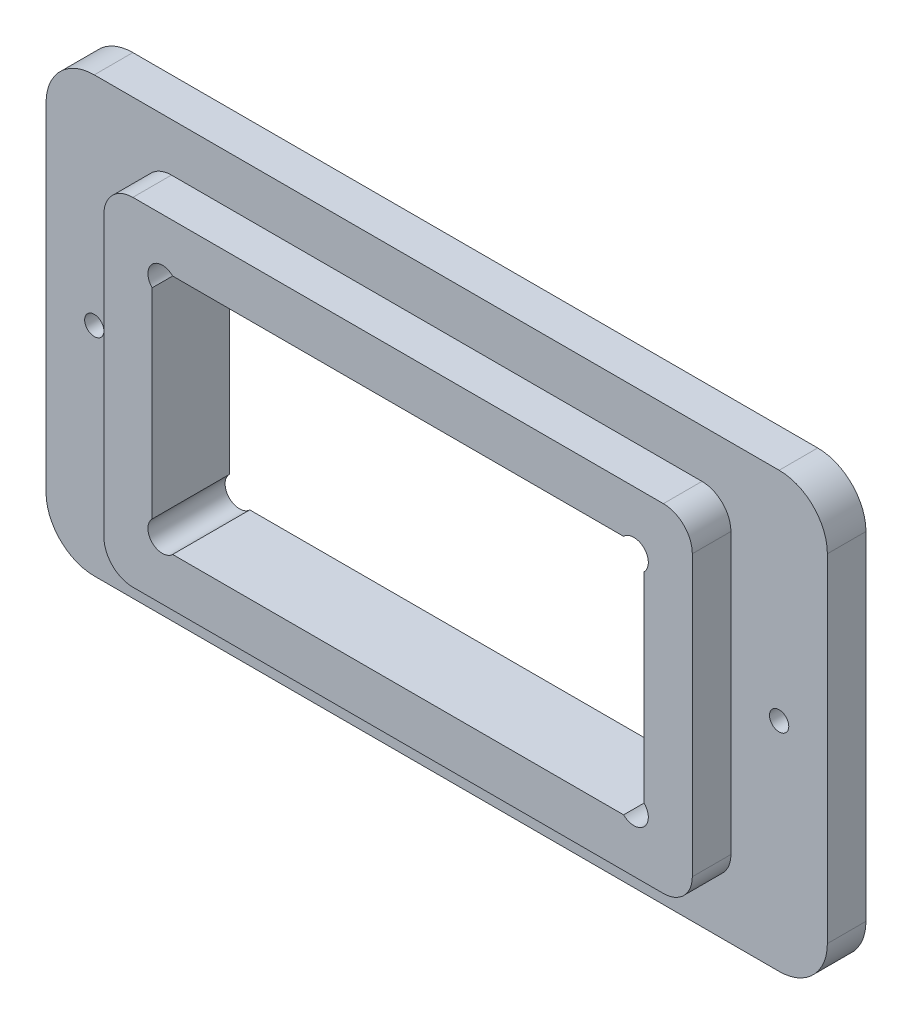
from build123d import *

# Parameters (mm, degrees)
BOSS_EXTRU_1_DEPTH      = 8
ESQUISSE2_OUTSIDE_W     = 101.602
ESQUISSE2_OUTSIDE_H     = 65.602
ESQUISSE2_OUTSIDE_W_2   = 61
ESQUISSE2_OUTSIDE_H_2   = 35
ENL_V_MAT_EXTRU_1_DEPTH = 4
ESQUISSE3_R             = 1
ENL_V_MAT_EXTRU_2_DEPTH = 10
CONG_1_R                = 3


with BuildPart() as part:
    # Esquisse1 → Boss.-Extru.1 (new body)
    with BuildSketch(Plane.XY):
        with BuildLine():
            Line((-54.251666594, 23.831506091), (16.748333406, 23.831506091))
            ThreePointArc((16.748333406, 23.831506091), (20.283867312, 22.367039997), (21.748333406, 18.831506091))
            Line((21.748333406, 18.831506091), (21.748333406, -16.168493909))
            ThreePointArc((21.748333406, -16.168493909), (20.283867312, -19.704027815), (16.748333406, -21.168493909))
            Line((16.748333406, -21.168493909), (-54.251666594, -21.168493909))
            ThreePointArc((-54.251666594, -21.168493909), (-57.7872005, -19.704027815), (-59.251666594, -16.168493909))
            Line((-59.251666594, -16.168493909), (-59.251666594, 18.831506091))
            ThreePointArc((-59.251666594, 18.831506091), (-57.7872005, 22.367039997), (-54.251666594, 23.831506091))
        make_face()
        with BuildLine():
            Line((-42.13034625, 13.831506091), (4.627013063, 13.831506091))
            ThreePointArc((4.627013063, 13.831506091), (6.748333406, 13.831506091), (6.748333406, 11.710185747))
            Line((6.748333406, 11.710185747), (6.748333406, -9.047173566))
            ThreePointArc((6.748333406, -9.047173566), (6.748333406, -11.168493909), (4.627013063, -11.168493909))
            Line((4.627013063, -11.168493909), (-42.13034625, -11.168493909))
            ThreePointArc((-42.13034625, -11.168493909), (-44.251666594, -11.168493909), (-44.251666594, -9.047173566))
            Line((-44.251666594, -9.047173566), (-44.251666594, 11.710185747))
            ThreePointArc((-44.251666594, 11.710185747), (-44.251666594, 13.831506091), (-42.13034625, 13.831506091))
        make_face(mode=Mode.SUBTRACT)
    extrude(amount=BOSS_EXTRU_1_DEPTH)

    # Esquisse2 outside → Enl_v. mat.-Extru.1 (cut)
    with BuildSketch(Plane.XY.offset(8)):
        with Locations((-18.752, 1.332)):
            Rectangle(ESQUISSE2_OUTSIDE_W, ESQUISSE2_OUTSIDE_H)
        with Locations((-18.751666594, 1.331506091)):
            Rectangle(ESQUISSE2_OUTSIDE_W_2, ESQUISSE2_OUTSIDE_H_2, mode=Mode.SUBTRACT)
    extrude(amount=-ENL_V_MAT_EXTRU_1_DEPTH, mode=Mode.SUBTRACT)

    # Esquisse3 → Enl_v. mat.-Extru.2 (cut)
    with BuildSketch(Plane.XY.offset(4)):
        with Locations((-54.251666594, 1.331506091)):
            Circle(ESQUISSE3_R)
        with Locations((16.748333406, 1.331506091)):
            Circle(ESQUISSE3_R)
    extrude(amount=-ENL_V_MAT_EXTRU_2_DEPTH, mode=Mode.SUBTRACT)

    # Cong_1
    cong_1_edges = [part.edges().sort_by_distance(p)[0] for p in [
        (-49.251666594, 18.831506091, 6),
        (11.748333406, 18.831506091, 6),
        (11.748333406, -16.168493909, 6),
        (-49.251666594, -16.168493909, 6),
    ]]
    fillet(cong_1_edges, radius=CONG_1_R)


solid = part.part
